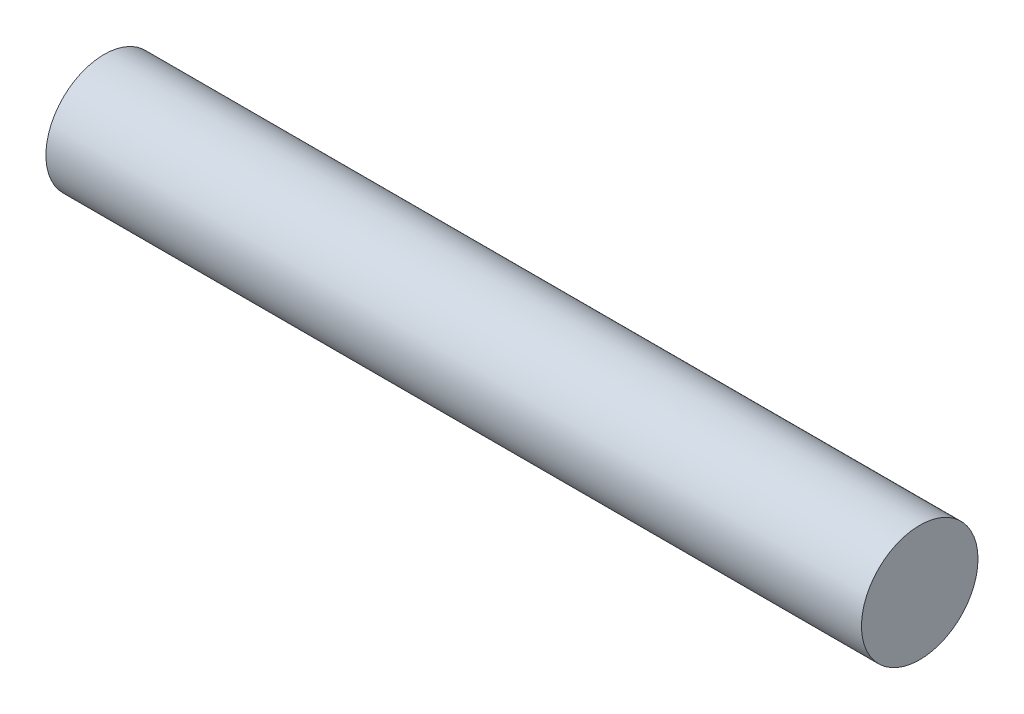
from build123d import *

# Parameters (mm, degrees)
SKETCH1_R  = 5
BASE_DEPTH = 70


with BuildPart() as part:
    # Sketch1 → Base (new body)
    with BuildSketch(Plane(origin=(0, 0, 0), x_dir=(0, 0, -1), z_dir=(1, 0, 0))):
        Circle(SKETCH1_R)
    extrude(amount=BASE_DEPTH)


solid = part.part
